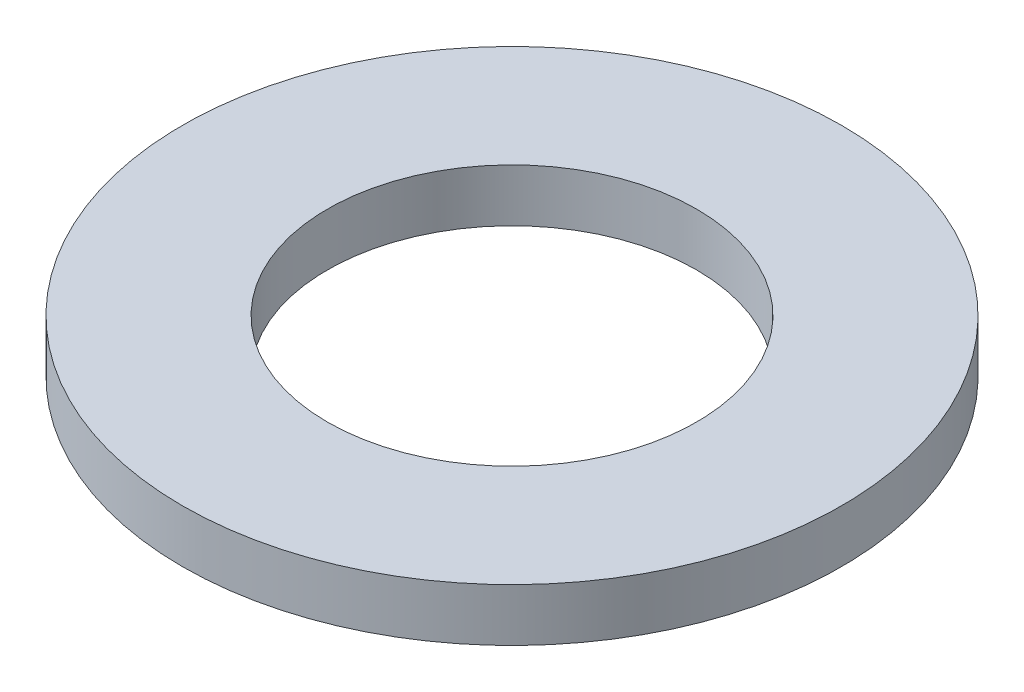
from build123d import *

# Parameters (mm, degrees)
SKETCH1_R      = 25
SKETCH1_R_2    = 14
EXTRUDE1_DEPTH = 4


with BuildPart() as part:
    # Sketch1 → Extrude1 (new body)
    with BuildSketch(Plane(origin=(0, 0, 0), x_dir=(1, 0, 0), z_dir=(0, 1, 0))):
        with Locations(Location((0, 0, 0), (0, 0, 270))):
            Circle(SKETCH1_R)
        with Locations(Location((0, 0, 0), (0, 0, 270))):
            Circle(SKETCH1_R_2, mode=Mode.SUBTRACT)
    extrude(amount=EXTRUDE1_DEPTH)


solid = part.part
